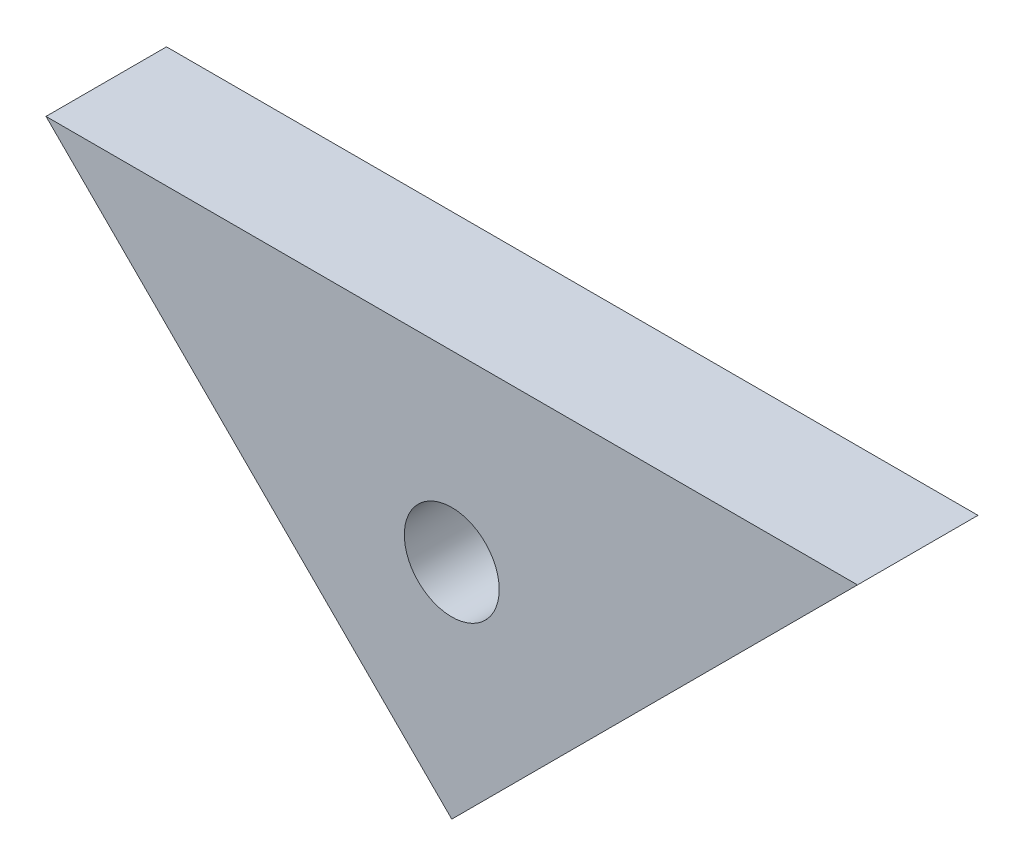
ISO-10303-21;
HEADER;
FILE_DESCRIPTION(('STEP AP214'),'2;1');
FILE_NAME('part.step','',(''),(''),'','','');
FILE_SCHEMA(('AUTOMOTIVE_DESIGN { 1 0 10303 214 1 1 1 1 }'));
ENDSEC;
DATA;
#1=APPLICATION_CONTEXT('core data for automotive mechanical design processes');
#2=APPLICATION_PROTOCOL_DEFINITION('international standard','automotive_design',2000,#1);
#3=PRODUCT_CONTEXT('',#1,'mechanical');
#4=PRODUCT('Part','Part','',(#3));
#5=PRODUCT_RELATED_PRODUCT_CATEGORY('part','',(#4));
#6=PRODUCT_DEFINITION_FORMATION('','',#4);
#7=PRODUCT_DEFINITION_CONTEXT('part definition',#1,'design');
#8=PRODUCT_DEFINITION('design','',#6,#7);
#9=PRODUCT_DEFINITION_SHAPE('','',#8);
#10=(LENGTH_UNIT() NAMED_UNIT(*) SI_UNIT(.MILLI.,.METRE.));
#11=(NAMED_UNIT(*) PLANE_ANGLE_UNIT() SI_UNIT($,.RADIAN.));
#12=(NAMED_UNIT(*) SI_UNIT($,.STERADIAN.) SOLID_ANGLE_UNIT());
#13=UNCERTAINTY_MEASURE_WITH_UNIT(LENGTH_MEASURE(1.E-05),#10,'distance_accuracy_value','');
#14=(GEOMETRIC_REPRESENTATION_CONTEXT(3) GLOBAL_UNCERTAINTY_ASSIGNED_CONTEXT((#13)) GLOBAL_UNIT_ASSIGNED_CONTEXT((#10,
#11,#12)) REPRESENTATION_CONTEXT('',''));
#15=CARTESIAN_POINT('',(0.,0.,0.));
#16=DIRECTION('',(0.,0.,1.));
#17=DIRECTION('',(1.,0.,0.));
#18=AXIS2_PLACEMENT_3D('',#15,#16,#17);
#19=CARTESIAN_POINT('',(0.,0.,4.));
#20=DIRECTION('',(-0.707106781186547,0.707106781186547,0.));
#21=DIRECTION('',(-0.707106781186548,-0.707106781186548,0.));
#22=AXIS2_PLACEMENT_3D('',#19,#20,#21);
#23=PLANE('',#22);
#24=DIRECTION('',(0.707106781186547,0.707106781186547,0.));
#25=VECTOR('',#24,1.);
#26=CARTESIAN_POINT('',(0.,0.,0.));
#27=LINE('',#26,#25);
#28=CARTESIAN_POINT('',(0.,0.,0.));
#29=VERTEX_POINT('',#28);
#30=CARTESIAN_POINT('',(13.4703841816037,13.4703841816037,0.));
#31=VERTEX_POINT('',#30);
#32=EDGE_CURVE('E90',#29,#31,#27,.T.);
#33=ORIENTED_EDGE('',*,*,#32,.T.);
#34=DIRECTION('',(0.,0.,-1.));
#35=VECTOR('',#34,1.);
#36=CARTESIAN_POINT('',(13.4703841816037,13.4703841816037,4.));
#37=LINE('',#36,#35);
#38=CARTESIAN_POINT('',(13.4703841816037,13.4703841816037,4.));
#39=VERTEX_POINT('',#38);
#40=EDGE_CURVE('E11',#39,#31,#37,.T.);
#41=ORIENTED_EDGE('',*,*,#40,.F.);
#42=DIRECTION('',(0.707106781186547,0.707106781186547,0.));
#43=VECTOR('',#42,1.);
#44=CARTESIAN_POINT('',(0.,0.,4.));
#45=LINE('',#44,#43);
#46=CARTESIAN_POINT('',(0.,0.,4.));
#47=VERTEX_POINT('',#46);
#48=EDGE_CURVE('E81',#47,#39,#45,.T.);
#49=ORIENTED_EDGE('',*,*,#48,.F.);
#50=DIRECTION('',(0.,0.,-1.));
#51=VECTOR('',#50,1.);
#52=CARTESIAN_POINT('',(0.,0.,4.));
#53=LINE('',#52,#51);
#54=EDGE_CURVE('E63',#47,#29,#53,.T.);
#55=ORIENTED_EDGE('',*,*,#54,.T.);
#56=EDGE_LOOP('',(#33,#41,#49,#55));
#57=FACE_BOUND('',#56,.T.);
#58=ADVANCED_FACE('F45',(#57),#23,.F.);
#59=CARTESIAN_POINT('',(-13.4703841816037,13.4703841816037,4.));
#60=DIRECTION('',(0.,1.,0.));
#61=DIRECTION('',(0.,0.,1.));
#62=AXIS2_PLACEMENT_3D('',#59,#60,#61);
#63=PLANE('',#62);
#64=DIRECTION('',(1.,0.,0.));
#65=VECTOR('',#64,1.);
#66=CARTESIAN_POINT('',(-13.4703841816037,13.4703841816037,0.));
#67=LINE('',#66,#65);
#68=CARTESIAN_POINT('',(-13.4703841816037,13.4703841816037,0.));
#69=VERTEX_POINT('',#68);
#70=EDGE_CURVE('E102',#69,#31,#67,.T.);
#71=ORIENTED_EDGE('',*,*,#70,.F.);
#72=DIRECTION('',(0.,0.,-1.));
#73=VECTOR('',#72,1.);
#74=CARTESIAN_POINT('',(-13.4703841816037,13.4703841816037,4.));
#75=LINE('',#74,#73);
#76=CARTESIAN_POINT('',(-13.4703841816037,13.4703841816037,4.));
#77=VERTEX_POINT('',#76);
#78=EDGE_CURVE('E55',#77,#69,#75,.T.);
#79=ORIENTED_EDGE('',*,*,#78,.F.);
#80=DIRECTION('',(1.,0.,0.));
#81=VECTOR('',#80,1.);
#82=CARTESIAN_POINT('',(-13.4703841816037,13.4703841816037,4.));
#83=LINE('',#82,#81);
#84=EDGE_CURVE('E85',#77,#39,#83,.T.);
#85=ORIENTED_EDGE('',*,*,#84,.T.);
#86=ORIENTED_EDGE('',*,*,#40,.T.);
#87=EDGE_LOOP('',(#71,#79,#85,#86));
#88=FACE_BOUND('',#87,.T.);
#89=ADVANCED_FACE('F93',(#88),#63,.T.);
#90=CARTESIAN_POINT('',(0.,0.,4.));
#91=DIRECTION('',(-0.707106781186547,-0.707106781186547,0.));
#92=DIRECTION('',(0.707106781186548,-0.707106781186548,0.));
#93=AXIS2_PLACEMENT_3D('',#90,#91,#92);
#94=PLANE('',#93);
#95=DIRECTION('',(-0.707106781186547,0.707106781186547,0.));
#96=VECTOR('',#95,1.);
#97=CARTESIAN_POINT('',(0.,0.,0.));
#98=LINE('',#97,#96);
#99=EDGE_CURVE('E88',#29,#69,#98,.T.);
#100=ORIENTED_EDGE('',*,*,#99,.F.);
#101=ORIENTED_EDGE('',*,*,#54,.F.);
#102=DIRECTION('',(-0.707106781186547,0.707106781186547,0.));
#103=VECTOR('',#102,1.);
#104=CARTESIAN_POINT('',(0.,0.,4.));
#105=LINE('',#104,#103);
#106=EDGE_CURVE('E86',#47,#77,#105,.T.);
#107=ORIENTED_EDGE('',*,*,#106,.T.);
#108=ORIENTED_EDGE('',*,*,#78,.T.);
#109=EDGE_LOOP('',(#100,#101,#107,#108));
#110=FACE_BOUND('',#109,.T.);
#111=ADVANCED_FACE('F113',(#110),#94,.T.);
#112=CARTESIAN_POINT('',(0.,0.,4.));
#113=DIRECTION('',(0.,0.,1.));
#114=DIRECTION('',(1.,0.,0.));
#115=AXIS2_PLACEMENT_3D('',#112,#113,#114);
#116=PLANE('',#115);
#117=CARTESIAN_POINT('',(0.,7.38927594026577,4.));
#118=DIRECTION('',(0.,0.,1.));
#119=DIRECTION('',(1.,0.,0.));
#120=AXIS2_PLACEMENT_3D('',#117,#118,#119);
#121=CIRCLE('',#120,1.575);
#122=CARTESIAN_POINT('',(1.575,7.38927594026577,4.));
#123=VERTEX_POINT('',#122);
#124=EDGE_CURVE('E166',#123,#123,#121,.T.);
#125=ORIENTED_EDGE('',*,*,#124,.F.);
#126=EDGE_LOOP('',(#125));
#127=FACE_BOUND('',#126,.T.);
#128=ORIENTED_EDGE('',*,*,#48,.T.);
#129=ORIENTED_EDGE('',*,*,#84,.F.);
#130=ORIENTED_EDGE('',*,*,#106,.F.);
#131=EDGE_LOOP('',(#128,#129,#130));
#132=FACE_BOUND('',#131,.T.);
#133=ADVANCED_FACE('F83',(#127,#132),#116,.T.);
#134=CARTESIAN_POINT('',(0.,0.,0.));
#135=DIRECTION('',(0.,0.,1.));
#136=DIRECTION('',(1.,0.,0.));
#137=AXIS2_PLACEMENT_3D('',#134,#135,#136);
#138=PLANE('',#137);
#139=CARTESIAN_POINT('',(0.,7.38927594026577,0.));
#140=DIRECTION('',(0.,0.,1.));
#141=DIRECTION('',(1.,0.,0.));
#142=AXIS2_PLACEMENT_3D('',#139,#140,#141);
#143=CIRCLE('',#142,1.575);
#144=CARTESIAN_POINT('',(1.575,7.38927594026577,0.));
#145=VERTEX_POINT('',#144);
#146=EDGE_CURVE('E48',#145,#145,#143,.T.);
#147=ORIENTED_EDGE('',*,*,#146,.T.);
#148=EDGE_LOOP('',(#147));
#149=FACE_BOUND('',#148,.T.);
#150=ORIENTED_EDGE('',*,*,#32,.F.);
#151=ORIENTED_EDGE('',*,*,#99,.T.);
#152=ORIENTED_EDGE('',*,*,#70,.T.);
#153=EDGE_LOOP('',(#150,#151,#152));
#154=FACE_BOUND('',#153,.T.);
#155=ADVANCED_FACE('F112',(#149,#154),#138,.F.);
#156=CARTESIAN_POINT('',(0.,7.38927594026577,-1.));
#157=DIRECTION('',(0.,0.,1.));
#158=DIRECTION('',(1.,0.,0.));
#159=AXIS2_PLACEMENT_3D('',#156,#157,#158);
#160=CYLINDRICAL_SURFACE('',#159,1.575);
#161=ORIENTED_EDGE('',*,*,#124,.T.);
#162=EDGE_LOOP('',(#161));
#163=FACE_BOUND('',#162,.T.);
#164=ORIENTED_EDGE('',*,*,#146,.F.);
#165=EDGE_LOOP('',(#164));
#166=FACE_BOUND('',#165,.T.);
#167=ADVANCED_FACE('F151',(#163,#166),#160,.F.);
#168=CLOSED_SHELL('',(#58,#89,#111,#133,#155,#167));
#169=MANIFOLD_SOLID_BREP('B2',#168);
#170=ADVANCED_BREP_SHAPE_REPRESENTATION('',(#18,#169),#14);
#171=SHAPE_DEFINITION_REPRESENTATION(#9,#170);
ENDSEC;
END-ISO-10303-21;
